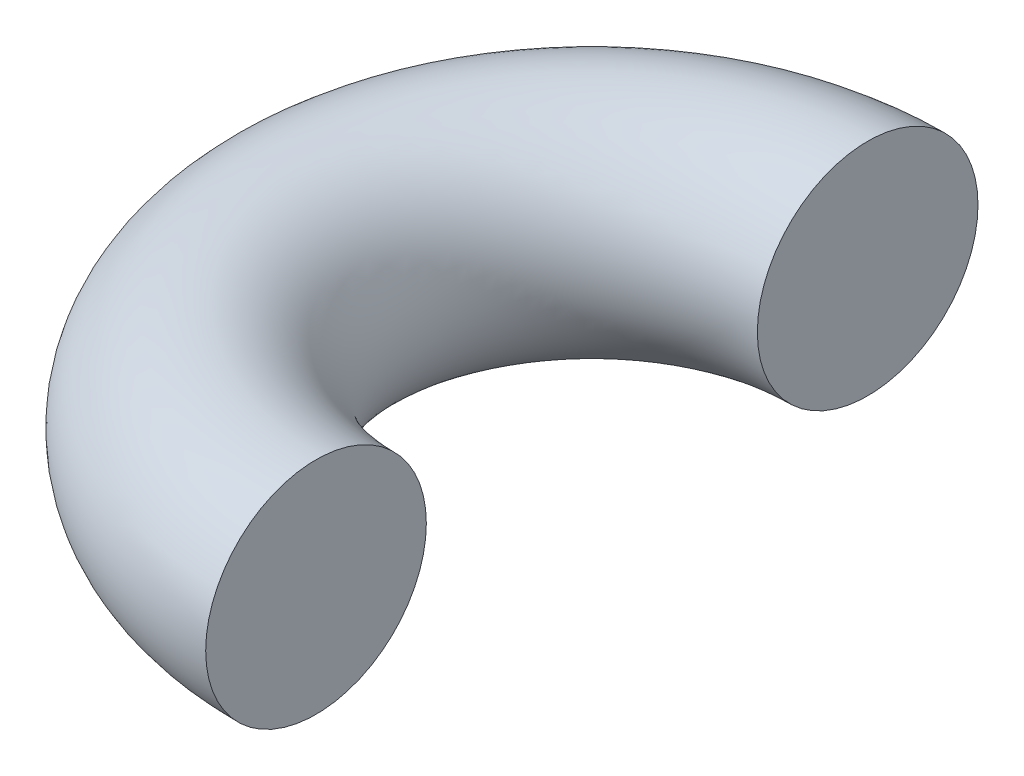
ISO-10303-21;
HEADER;
FILE_DESCRIPTION(('STEP AP214'),'2;1');
FILE_NAME('part.step','',(''),(''),'','','');
FILE_SCHEMA(('AUTOMOTIVE_DESIGN { 1 0 10303 214 1 1 1 1 }'));
ENDSEC;
DATA;
#1=APPLICATION_CONTEXT('core data for automotive mechanical design processes');
#2=APPLICATION_PROTOCOL_DEFINITION('international standard','automotive_design',2000,#1);
#3=PRODUCT_CONTEXT('',#1,'mechanical');
#4=PRODUCT('Part','Part','',(#3));
#5=PRODUCT_RELATED_PRODUCT_CATEGORY('part','',(#4));
#6=PRODUCT_DEFINITION_FORMATION('','',#4);
#7=PRODUCT_DEFINITION_CONTEXT('part definition',#1,'design');
#8=PRODUCT_DEFINITION('design','',#6,#7);
#9=PRODUCT_DEFINITION_SHAPE('','',#8);
#10=(LENGTH_UNIT() NAMED_UNIT(*) SI_UNIT(.MILLI.,.METRE.));
#11=(NAMED_UNIT(*) PLANE_ANGLE_UNIT() SI_UNIT($,.RADIAN.));
#12=(NAMED_UNIT(*) SI_UNIT($,.STERADIAN.) SOLID_ANGLE_UNIT());
#13=UNCERTAINTY_MEASURE_WITH_UNIT(LENGTH_MEASURE(1.E-05),#10,'distance_accuracy_value','');
#14=(GEOMETRIC_REPRESENTATION_CONTEXT(3) GLOBAL_UNCERTAINTY_ASSIGNED_CONTEXT((#13)) GLOBAL_UNIT_ASSIGNED_CONTEXT((#10,
#11,#12)) REPRESENTATION_CONTEXT('',''));
#15=CARTESIAN_POINT('',(0.,0.,0.));
#16=DIRECTION('',(0.,0.,1.));
#17=DIRECTION('',(1.,0.,0.));
#18=AXIS2_PLACEMENT_3D('',#15,#16,#17);
#19=CARTESIAN_POINT('',(0.,0.,0.));
#20=DIRECTION('',(0.,1.,0.));
#21=DIRECTION('',(0.,0.,1.));
#22=AXIS2_PLACEMENT_3D('',#19,#20,#21);
#23=TOROIDAL_SURFACE('',#22,50.,20.);
#24=CARTESIAN_POINT('',(0.,0.,-50.));
#25=DIRECTION('',(-1.,0.,0.));
#26=DIRECTION('',(0.,0.,1.));
#27=AXIS2_PLACEMENT_3D('',#24,#25,#26);
#28=CIRCLE('',#27,20.);
#29=CARTESIAN_POINT('',(0.,0.,-70.));
#30=VERTEX_POINT('',#29);
#31=EDGE_CURVE('E50',#30,#30,#28,.T.);
#32=CARTESIAN_POINT('',(0.,0.,50.));
#33=DIRECTION('',(-1.,0.,0.));
#34=DIRECTION('',(0.,0.,1.));
#35=AXIS2_PLACEMENT_3D('',#32,#33,#34);
#36=CIRCLE('',#35,20.);
#37=CARTESIAN_POINT('',(0.,0.,70.));
#38=VERTEX_POINT('',#37);
#39=EDGE_CURVE('E10',#38,#38,#36,.T.);
#40=CARTESIAN_POINT('',(0.,0.,0.));
#41=DIRECTION('',(0.,1.,0.));
#42=DIRECTION('',(0.,0.,1.));
#43=AXIS2_PLACEMENT_3D('',#40,#41,#42);
#44=CIRCLE('',#43,70.);
#45=EDGE_CURVE('',#30,#38,#44,.T.);
#46=ORIENTED_EDGE('',*,*,#31,.T.);
#47=ORIENTED_EDGE('',*,*,#39,.T.);
#48=ORIENTED_EDGE('',*,*,#45,.T.);
#49=ORIENTED_EDGE('',*,*,#45,.F.);
#50=EDGE_LOOP('',(#46,#48,#47,#49));
#51=FACE_BOUND('',#50,.T.);
#52=ADVANCED_FACE('F43',(#51),#23,.T.);
#53=CARTESIAN_POINT('',(0.,-20.,-70.));
#54=DIRECTION('',(-1.,0.,0.));
#55=DIRECTION('',(0.,0.,1.));
#56=AXIS2_PLACEMENT_3D('',#53,#54,#55);
#57=PLANE('',#56);
#58=ORIENTED_EDGE('',*,*,#31,.F.);
#59=EDGE_LOOP('',(#58));
#60=FACE_BOUND('',#59,.T.);
#61=ADVANCED_FACE('F58',(#60),#57,.F.);
#62=ORIENTED_EDGE('',*,*,#39,.F.);
#63=EDGE_LOOP('',(#62));
#64=FACE_BOUND('',#63,.T.);
#65=ADVANCED_FACE('F60',(#64),#57,.F.);
#66=CLOSED_SHELL('',(#52,#61,#65));
#67=MANIFOLD_SOLID_BREP('B2',#66);
#68=ADVANCED_BREP_SHAPE_REPRESENTATION('',(#18,#67),#14);
#69=SHAPE_DEFINITION_REPRESENTATION(#9,#68);
ENDSEC;
END-ISO-10303-21;
